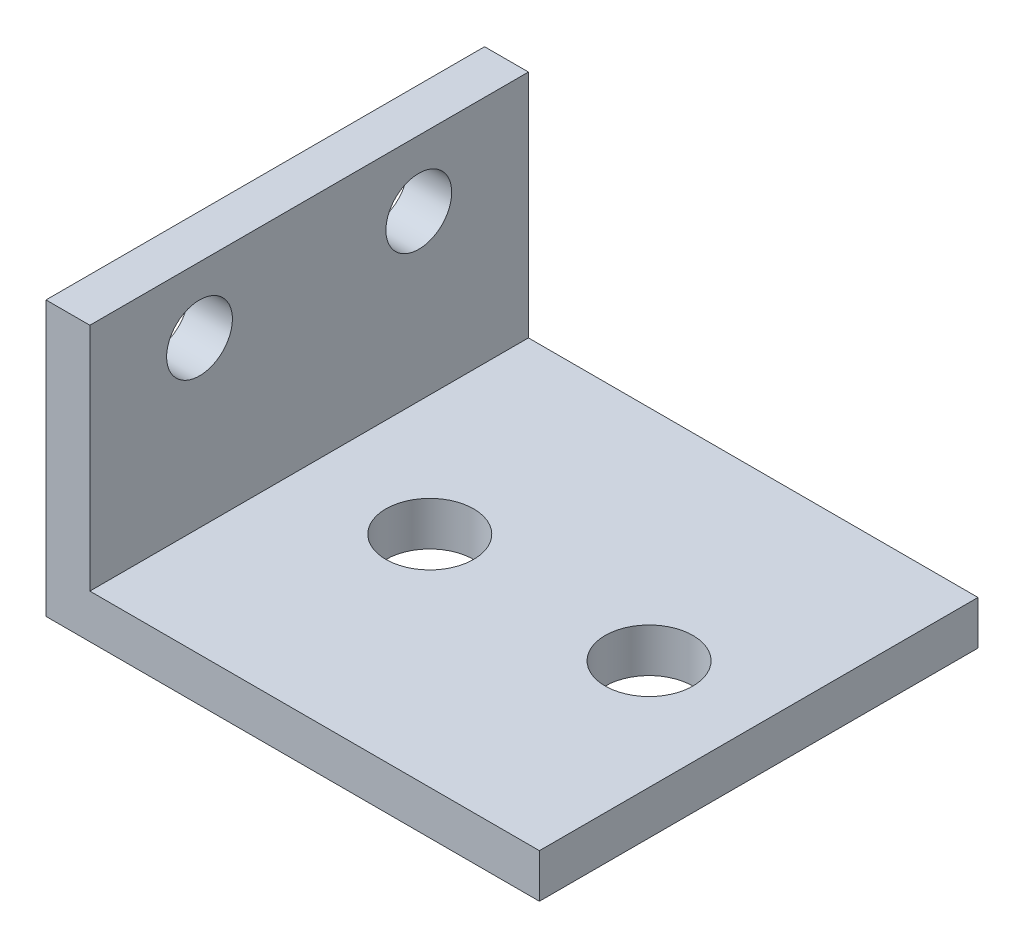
from build123d import *

# Parameters (mm, degrees)
BOSS_EXTRU_1_DEPTH      = 40
ESQUISSE2_R             = 3
ENL_V_MAT_EXTRU_1_DEPTH = 40
ESQUISSE3_R             = 4
ENL_V_MAT_EXTRU_2_DEPTH = 40


with BuildPart() as part:
    # Esquisse1 → Boss.-Extru.1 (new body)
    with BuildSketch(Plane.XY):
        Polygon((0, 0), (0, 25), (4, 25), (4, 4), (45, 4), (45, 0), align=None)
    extrude(amount=BOSS_EXTRU_1_DEPTH)

    # Esquisse2 → Enl_v. mat.-Extru.1 (cut)
    with BuildSketch(Plane(origin=(4, 0, 0), x_dir=(0, 0, -1), z_dir=(1, 0, 0))):
        with Locations(Location((-30, 19, 0), (0, 0, 90))):
            Circle(ESQUISSE2_R)
        with Locations(Location((-10, 19, 0), (0, 0, 90))):
            Circle(ESQUISSE2_R)
    extrude(amount=-ENL_V_MAT_EXTRU_1_DEPTH, mode=Mode.SUBTRACT)

    # Esquisse3 → Enl_v. mat.-Extru.2 (cut)
    with BuildSketch(Plane(origin=(0, 4, 0), x_dir=(1, 0, 0), z_dir=(0, 1, 0))):
        with Locations(Location((15, -20, 0), (0, 0, 180))):
            Circle(ESQUISSE3_R)
        with Locations(Location((35, -20, 0), (0, 0, 180))):
            Circle(ESQUISSE3_R)
    extrude(amount=-ENL_V_MAT_EXTRU_2_DEPTH, mode=Mode.SUBTRACT)


solid = part.part
